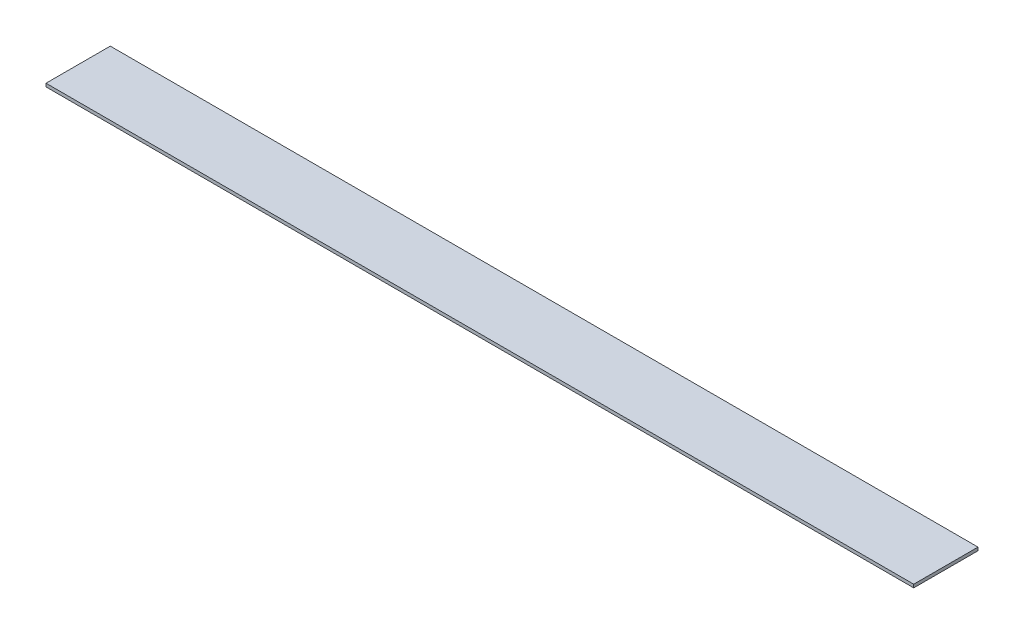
ISO-10303-21;
HEADER;
FILE_DESCRIPTION(('STEP AP214'),'2;1');
FILE_NAME('part.step','',(''),(''),'','','');
FILE_SCHEMA(('AUTOMOTIVE_DESIGN { 1 0 10303 214 1 1 1 1 }'));
ENDSEC;
DATA;
#1=APPLICATION_CONTEXT('core data for automotive mechanical design processes');
#2=APPLICATION_PROTOCOL_DEFINITION('international standard','automotive_design',2000,#1);
#3=PRODUCT_CONTEXT('',#1,'mechanical');
#4=PRODUCT('Part','Part','',(#3));
#5=PRODUCT_RELATED_PRODUCT_CATEGORY('part','',(#4));
#6=PRODUCT_DEFINITION_FORMATION('','',#4);
#7=PRODUCT_DEFINITION_CONTEXT('part definition',#1,'design');
#8=PRODUCT_DEFINITION('design','',#6,#7);
#9=PRODUCT_DEFINITION_SHAPE('','',#8);
#10=(LENGTH_UNIT() NAMED_UNIT(*) SI_UNIT(.MILLI.,.METRE.));
#11=(NAMED_UNIT(*) PLANE_ANGLE_UNIT() SI_UNIT($,.RADIAN.));
#12=(NAMED_UNIT(*) SI_UNIT($,.STERADIAN.) SOLID_ANGLE_UNIT());
#13=UNCERTAINTY_MEASURE_WITH_UNIT(LENGTH_MEASURE(1.E-05),#10,'distance_accuracy_value','');
#14=(GEOMETRIC_REPRESENTATION_CONTEXT(3) GLOBAL_UNCERTAINTY_ASSIGNED_CONTEXT((#13)) GLOBAL_UNIT_ASSIGNED_CONTEXT((#10,
#11,#12)) REPRESENTATION_CONTEXT('',''));
#15=CARTESIAN_POINT('',(0.,0.,0.));
#16=DIRECTION('',(0.,0.,1.));
#17=DIRECTION('',(1.,0.,0.));
#18=AXIS2_PLACEMENT_3D('',#15,#16,#17);
#19=CARTESIAN_POINT('',(0.,0.,-20.));
#20=DIRECTION('',(-1.,0.,0.));
#21=DIRECTION('',(0.,0.,1.));
#22=AXIS2_PLACEMENT_3D('',#19,#20,#21);
#23=PLANE('',#22);
#24=DIRECTION('',(0.,-1.,0.));
#25=VECTOR('',#24,1.);
#26=CARTESIAN_POINT('',(0.,0.,0.));
#27=LINE('',#26,#25);
#28=CARTESIAN_POINT('',(0.,1.,0.));
#29=VERTEX_POINT('',#28);
#30=CARTESIAN_POINT('',(0.,0.,0.));
#31=VERTEX_POINT('',#30);
#32=EDGE_CURVE('E66',#29,#31,#27,.T.);
#33=ORIENTED_EDGE('',*,*,#32,.F.);
#34=DIRECTION('',(0.,0.,1.));
#35=VECTOR('',#34,1.);
#36=CARTESIAN_POINT('',(0.,1.,-20.));
#37=LINE('',#36,#35);
#38=CARTESIAN_POINT('',(0.,1.,-20.));
#39=VERTEX_POINT('',#38);
#40=EDGE_CURVE('E11',#39,#29,#37,.T.);
#41=ORIENTED_EDGE('',*,*,#40,.F.);
#42=DIRECTION('',(0.,-1.,0.));
#43=VECTOR('',#42,1.);
#44=CARTESIAN_POINT('',(0.,0.,-20.));
#45=LINE('',#44,#43);
#46=CARTESIAN_POINT('',(0.,0.,-20.));
#47=VERTEX_POINT('',#46);
#48=EDGE_CURVE('E68',#39,#47,#45,.T.);
#49=ORIENTED_EDGE('',*,*,#48,.T.);
#50=DIRECTION('',(0.,0.,1.));
#51=VECTOR('',#50,1.);
#52=CARTESIAN_POINT('',(0.,0.,-20.));
#53=LINE('',#52,#51);
#54=EDGE_CURVE('E29',#47,#31,#53,.T.);
#55=ORIENTED_EDGE('',*,*,#54,.T.);
#56=EDGE_LOOP('',(#33,#41,#49,#55));
#57=FACE_BOUND('',#56,.T.);
#58=ADVANCED_FACE('F26',(#57),#23,.T.);
#59=CARTESIAN_POINT('',(0.,1.,-20.));
#60=DIRECTION('',(0.,1.,0.));
#61=DIRECTION('',(0.,0.,1.));
#62=AXIS2_PLACEMENT_3D('',#59,#60,#61);
#63=PLANE('',#62);
#64=DIRECTION('',(-1.,0.,0.));
#65=VECTOR('',#64,1.);
#66=CARTESIAN_POINT('',(0.,1.,0.));
#67=LINE('',#66,#65);
#68=CARTESIAN_POINT('',(270.,1.,0.));
#69=VERTEX_POINT('',#68);
#70=EDGE_CURVE('E83',#69,#29,#67,.T.);
#71=ORIENTED_EDGE('',*,*,#70,.F.);
#72=DIRECTION('',(0.,0.,1.));
#73=VECTOR('',#72,1.);
#74=CARTESIAN_POINT('',(270.,1.,-20.));
#75=LINE('',#74,#73);
#76=CARTESIAN_POINT('',(270.,1.,-20.));
#77=VERTEX_POINT('',#76);
#78=EDGE_CURVE('E34',#77,#69,#75,.T.);
#79=ORIENTED_EDGE('',*,*,#78,.F.);
#80=DIRECTION('',(-1.,0.,0.));
#81=VECTOR('',#80,1.);
#82=CARTESIAN_POINT('',(0.,1.,-20.));
#83=LINE('',#82,#81);
#84=EDGE_CURVE('E73',#77,#39,#83,.T.);
#85=ORIENTED_EDGE('',*,*,#84,.T.);
#86=ORIENTED_EDGE('',*,*,#40,.T.);
#87=EDGE_LOOP('',(#71,#79,#85,#86));
#88=FACE_BOUND('',#87,.T.);
#89=ADVANCED_FACE('F98',(#88),#63,.T.);
#90=CARTESIAN_POINT('',(270.,0.,-20.));
#91=DIRECTION('',(1.,0.,0.));
#92=DIRECTION('',(0.,0.,-1.));
#93=AXIS2_PLACEMENT_3D('',#90,#91,#92);
#94=PLANE('',#93);
#95=DIRECTION('',(0.,1.,0.));
#96=VECTOR('',#95,1.);
#97=CARTESIAN_POINT('',(270.,0.,0.));
#98=LINE('',#97,#96);
#99=CARTESIAN_POINT('',(270.,0.,0.));
#100=VERTEX_POINT('',#99);
#101=EDGE_CURVE('E80',#100,#69,#98,.T.);
#102=ORIENTED_EDGE('',*,*,#101,.F.);
#103=DIRECTION('',(0.,0.,1.));
#104=VECTOR('',#103,1.);
#105=CARTESIAN_POINT('',(270.,0.,-20.));
#106=LINE('',#105,#104);
#107=CARTESIAN_POINT('',(270.,0.,-20.));
#108=VERTEX_POINT('',#107);
#109=EDGE_CURVE('E72',#108,#100,#106,.T.);
#110=ORIENTED_EDGE('',*,*,#109,.F.);
#111=DIRECTION('',(0.,1.,0.));
#112=VECTOR('',#111,1.);
#113=CARTESIAN_POINT('',(270.,0.,-20.));
#114=LINE('',#113,#112);
#115=EDGE_CURVE('E91',#108,#77,#114,.T.);
#116=ORIENTED_EDGE('',*,*,#115,.T.);
#117=ORIENTED_EDGE('',*,*,#78,.T.);
#118=EDGE_LOOP('',(#102,#110,#116,#117));
#119=FACE_BOUND('',#118,.T.);
#120=ADVANCED_FACE('F95',(#119),#94,.T.);
#121=CARTESIAN_POINT('',(0.,0.,-20.));
#122=DIRECTION('',(0.,-1.,0.));
#123=DIRECTION('',(0.,0.,-1.));
#124=AXIS2_PLACEMENT_3D('',#121,#122,#123);
#125=PLANE('',#124);
#126=DIRECTION('',(1.,0.,0.));
#127=VECTOR('',#126,1.);
#128=CARTESIAN_POINT('',(0.,0.,0.));
#129=LINE('',#128,#127);
#130=EDGE_CURVE('E75',#31,#100,#129,.T.);
#131=ORIENTED_EDGE('',*,*,#130,.F.);
#132=ORIENTED_EDGE('',*,*,#54,.F.);
#133=DIRECTION('',(1.,0.,0.));
#134=VECTOR('',#133,1.);
#135=CARTESIAN_POINT('',(0.,0.,-20.));
#136=LINE('',#135,#134);
#137=EDGE_CURVE('E89',#47,#108,#136,.T.);
#138=ORIENTED_EDGE('',*,*,#137,.T.);
#139=ORIENTED_EDGE('',*,*,#109,.T.);
#140=EDGE_LOOP('',(#131,#132,#138,#139));
#141=FACE_BOUND('',#140,.T.);
#142=ADVANCED_FACE('F76',(#141),#125,.T.);
#143=CARTESIAN_POINT('',(0.,1.,-20.));
#144=DIRECTION('',(0.,0.,-1.));
#145=DIRECTION('',(-1.,0.,0.));
#146=AXIS2_PLACEMENT_3D('',#143,#144,#145);
#147=PLANE('',#146);
#148=ORIENTED_EDGE('',*,*,#48,.F.);
#149=ORIENTED_EDGE('',*,*,#84,.F.);
#150=ORIENTED_EDGE('',*,*,#115,.F.);
#151=ORIENTED_EDGE('',*,*,#137,.F.);
#152=EDGE_LOOP('',(#148,#149,#150,#151));
#153=FACE_BOUND('',#152,.T.);
#154=ADVANCED_FACE('F100',(#153),#147,.T.);
#155=CARTESIAN_POINT('',(0.,1.,0.));
#156=DIRECTION('',(0.,0.,-1.));
#157=DIRECTION('',(-1.,0.,0.));
#158=AXIS2_PLACEMENT_3D('',#155,#156,#157);
#159=PLANE('',#158);
#160=ORIENTED_EDGE('',*,*,#32,.T.);
#161=ORIENTED_EDGE('',*,*,#130,.T.);
#162=ORIENTED_EDGE('',*,*,#101,.T.);
#163=ORIENTED_EDGE('',*,*,#70,.T.);
#164=EDGE_LOOP('',(#160,#161,#162,#163));
#165=FACE_BOUND('',#164,.T.);
#166=ADVANCED_FACE('F82',(#165),#159,.F.);
#167=CLOSED_SHELL('',(#58,#89,#120,#142,#154,#166));
#168=MANIFOLD_SOLID_BREP('B2',#167);
#169=ADVANCED_BREP_SHAPE_REPRESENTATION('',(#18,#168),#14);
#170=SHAPE_DEFINITION_REPRESENTATION(#9,#169);
ENDSEC;
END-ISO-10303-21;
